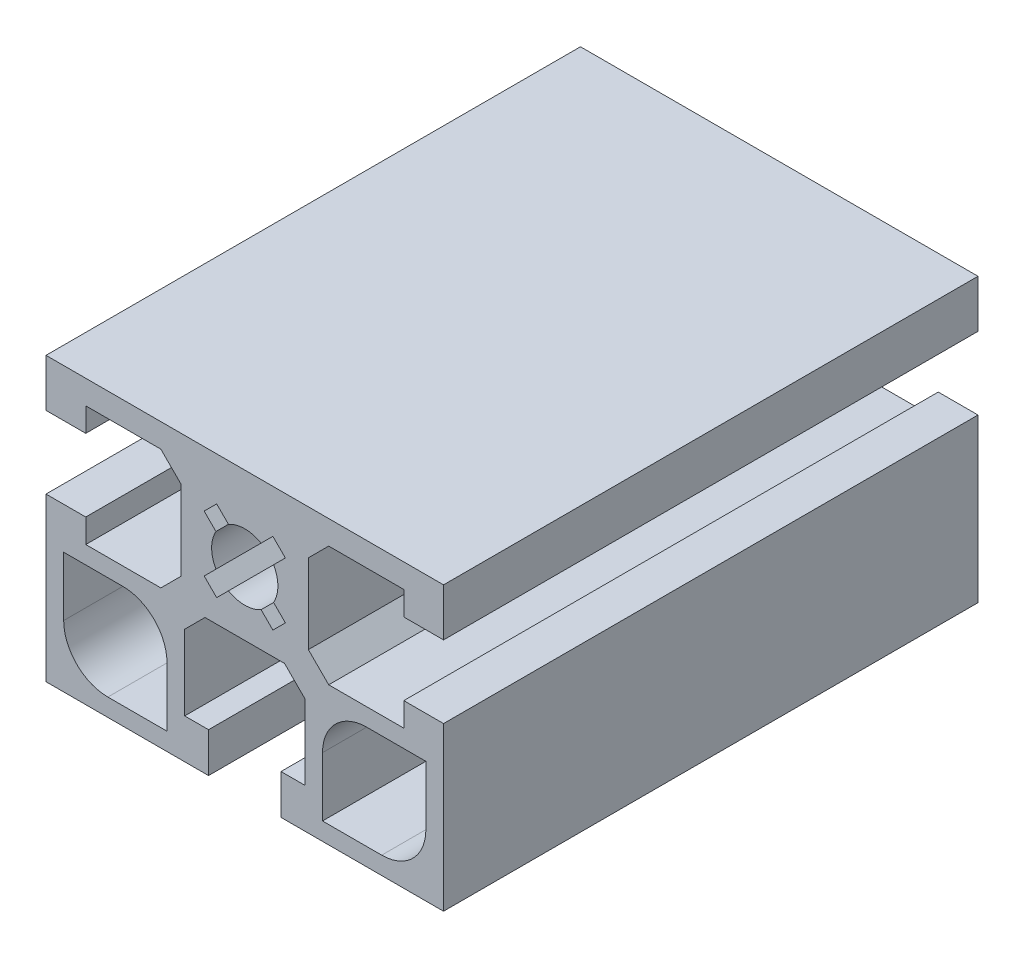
from build123d import *

# Parameters (mm, degrees)
EXTRUDE1_DEPTH      = 30.25
EXTRUDE1_DEPTH_BACK = 30.25


with BuildPart() as part:
    # Sketch1 → Extrude1 (new, two sides: drawn at the far end of the back side and taken through both)
    with BuildSketch(Plane.XY.offset(-EXTRUDE1_DEPTH_BACK)):
        Polygon((-22.499999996, -22.499999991), (-4.099999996, -22.499999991), (-4.099999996, -17.999999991), (-6.799999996, -17.999999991), (-6.799999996, -9.499999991), (-4.499999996, -7.199999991), (4.500000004, -7.199999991), (6.800000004, -9.499999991), (6.800000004, -17.999999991), (4.100000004, -17.999999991), (4.100000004, -22.499999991), (22.499999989, -22.499999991), (22.499999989, -4.099999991), (17.999999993, -4.099999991), (17.999999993, -6.799999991), (9.499999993, -6.799999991), (7.199999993, -4.499999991), (7.199999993, 4.500000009), (9.499999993, 6.800000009), (17.999999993, 6.800000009), (17.999999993, 4.100000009), (22.499999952, 4.100000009), (22.499999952, 9.499999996), (-22.499999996, 9.499999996), (-22.499999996, 4.100000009), (-17.999999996, 4.100000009), (-17.999999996, 6.800000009), (-9.499999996, 6.800000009), (-7.199999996, 4.500000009), (-7.199999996, -4.499999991), (-9.499999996, -6.799999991), (-17.999999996, -6.799999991), (-17.999999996, -4.099999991), (-22.499999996, -4.099999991), align=None)
        with BuildLine():
            Line((-20.499997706, -15.500002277), (-20.499997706, -8.799997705))
            Line((-20.499997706, -8.799997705), (-13.799993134, -8.799997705))
            ThreePointArc((-13.799993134, -8.799997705), (-10.264459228, -10.264463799), (-8.799993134, -13.799997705))
            Line((-8.799993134, -13.799997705), (-8.799993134, -20.500002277))
            Line((-8.799993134, -20.500002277), (-15.499997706, -20.500002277))
            ThreePointArc((-15.499997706, -20.500002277), (-19.035531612, -19.035536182), (-20.499997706, -15.500002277))
        make_face(mode=Mode.SUBTRACT)
        with BuildLine():
            Line((8.799993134, -20.500002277), (8.799993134, -13.799997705))
            ThreePointArc((8.799993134, -13.799997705), (10.264459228, -10.264463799), (13.799993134, -8.799997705))
            Line((13.799993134, -8.799997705), (20.499997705, -8.799997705))
            Line((20.499997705, -8.799997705), (20.499997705, -15.500002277))
            ThreePointArc((20.499997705, -15.500002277), (19.035531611, -19.035536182), (15.499997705, -20.500002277))
            Line((15.499997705, -20.500002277), (8.799993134, -20.500002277))
        make_face(mode=Mode.SUBTRACT)
        with BuildLine():
            Line((-3.262737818, 1.848524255), (-4.596194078, 3.181980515))
            Line((-4.596194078, 3.181980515), (-3.181980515, 4.596194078))
            Line((-3.181980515, 4.596194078), (-1.848524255, 3.262737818))
            ThreePointArc((-1.848524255, 3.262737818), (0, 3.749999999), (1.848524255, 3.262737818))
            Line((1.848524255, 3.262737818), (3.181980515, 4.596194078))
            Line((3.181980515, 4.596194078), (4.596194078, 3.181980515))
            Line((4.596194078, 3.181980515), (3.262737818, 1.848524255))
            ThreePointArc((3.262737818, 1.848524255), (3.749999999, 0), (3.262737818, -1.848524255))
            Line((3.262737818, -1.848524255), (4.596194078, -3.181980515))
            Line((4.596194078, -3.181980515), (3.181980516, -4.596194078))
            Line((3.181980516, -4.596194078), (1.848524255, -3.262737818))
            ThreePointArc((1.848524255, -3.262737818), (0, -3.749999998), (-1.848524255, -3.262737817))
            Line((-1.848524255, -3.262737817), (-3.181980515, -4.596194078))
            Line((-3.181980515, -4.596194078), (-4.596194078, -3.181980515))
            Line((-4.596194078, -3.181980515), (-3.262737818, -1.848524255))
            ThreePointArc((-3.262737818, -1.848524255), (-3.749999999, 0), (-3.262737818, 1.848524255))
        make_face(mode=Mode.SUBTRACT)
    extrude(amount=EXTRUDE1_DEPTH + EXTRUDE1_DEPTH_BACK)


solid = part.part
